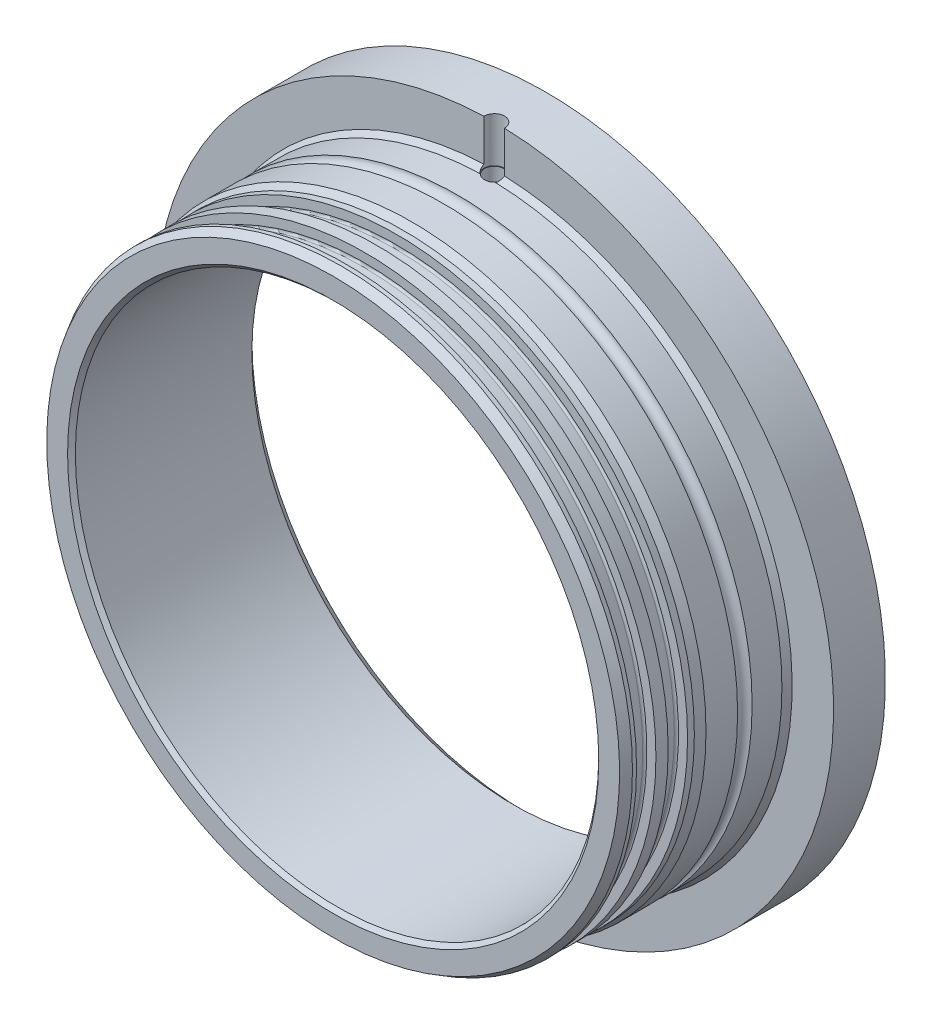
ISO-10303-21;
HEADER;
FILE_DESCRIPTION(('STEP AP214'),'2;1');
FILE_NAME('part.step','',(''),(''),'','','');
FILE_SCHEMA(('AUTOMOTIVE_DESIGN { 1 0 10303 214 1 1 1 1 }'));
ENDSEC;
DATA;
#1=APPLICATION_CONTEXT('core data for automotive mechanical design processes');
#2=APPLICATION_PROTOCOL_DEFINITION('international standard','automotive_design',2000,#1);
#3=PRODUCT_CONTEXT('',#1,'mechanical');
#4=PRODUCT('Part','Part','',(#3));
#5=PRODUCT_RELATED_PRODUCT_CATEGORY('part','',(#4));
#6=PRODUCT_DEFINITION_FORMATION('','',#4);
#7=PRODUCT_DEFINITION_CONTEXT('part definition',#1,'design');
#8=PRODUCT_DEFINITION('design','',#6,#7);
#9=PRODUCT_DEFINITION_SHAPE('','',#8);
#10=(LENGTH_UNIT() NAMED_UNIT(*) SI_UNIT(.MILLI.,.METRE.));
#11=(NAMED_UNIT(*) PLANE_ANGLE_UNIT() SI_UNIT($,.RADIAN.));
#12=(NAMED_UNIT(*) SI_UNIT($,.STERADIAN.) SOLID_ANGLE_UNIT());
#13=UNCERTAINTY_MEASURE_WITH_UNIT(LENGTH_MEASURE(1.E-05),#10,'distance_accuracy_value','');
#14=(GEOMETRIC_REPRESENTATION_CONTEXT(3) GLOBAL_UNCERTAINTY_ASSIGNED_CONTEXT((#13)) GLOBAL_UNIT_ASSIGNED_CONTEXT((#10,
#11,#12)) REPRESENTATION_CONTEXT('',''));
#15=CARTESIAN_POINT('',(0.,0.,0.));
#16=DIRECTION('',(0.,0.,1.));
#17=DIRECTION('',(1.,0.,0.));
#18=AXIS2_PLACEMENT_3D('',#15,#16,#17);
#19=CARTESIAN_POINT('',(0.,0.,-19.2957));
#20=DIRECTION('',(0.,0.,-1.));
#21=DIRECTION('',(0.,1.,0.));
#22=AXIS2_PLACEMENT_3D('',#19,#20,#21);
#23=PLANE('',#22);
#24=CARTESIAN_POINT('',(0.,0.,-19.2957));
#25=DIRECTION('',(0.,0.,-1.));
#26=DIRECTION('',(0.,1.,0.));
#27=AXIS2_PLACEMENT_3D('',#24,#25,#26);
#28=CIRCLE('',#27,72.7074999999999);
#29=CARTESIAN_POINT('',(0.,72.7074999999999,-19.2957));
#30=VERTEX_POINT('',#29);
#31=EDGE_CURVE('E13',#30,#30,#28,.T.);
#32=ORIENTED_EDGE('',*,*,#31,.T.);
#33=EDGE_LOOP('',(#32));
#34=FACE_BOUND('',#33,.T.);
#35=CARTESIAN_POINT('',(0.,0.,-19.2957));
#36=DIRECTION('',(0.,0.,-1.));
#37=DIRECTION('',(0.,1.,0.));
#38=AXIS2_PLACEMENT_3D('',#35,#36,#37);
#39=CIRCLE('',#38,66.6750000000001);
#40=CARTESIAN_POINT('',(0.,66.6750000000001,-19.2957));
#41=VERTEX_POINT('',#40);
#42=EDGE_CURVE('E674',#41,#41,#39,.F.);
#43=ORIENTED_EDGE('',*,*,#42,.T.);
#44=EDGE_LOOP('',(#43));
#45=FACE_BOUND('',#44,.T.);
#46=ADVANCED_FACE('F52',(#34,#45),#23,.T.);
#47=CARTESIAN_POINT('',(0.,0.,-11.9932));
#48=DIRECTION('',(0.,0.,-1.));
#49=DIRECTION('',(-1.,0.,0.));
#50=AXIS2_PLACEMENT_3D('',#47,#48,#49);
#51=PLANE('',#50);
#52=CARTESIAN_POINT('',(0.,0.,-11.9932));
#53=DIRECTION('',(0.,0.,-1.));
#54=DIRECTION('',(-1.,0.,0.));
#55=AXIS2_PLACEMENT_3D('',#52,#53,#54);
#56=CIRCLE('',#55,83.185);
#57=CARTESIAN_POINT('',(2.53999999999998,83.1462123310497,-11.9932));
#58=VERTEX_POINT('',#57);
#59=CARTESIAN_POINT('',(-2.54000000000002,83.1462138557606,-11.9932));
#60=VERTEX_POINT('',#59);
#61=EDGE_CURVE('E101',#58,#60,#56,.T.);
#62=ORIENTED_EDGE('',*,*,#61,.F.);
#63=DIRECTION('',(0.,-1.,0.));
#64=VECTOR('',#63,1.);
#65=CARTESIAN_POINT('',(2.53999999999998,83.185001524,-11.9932));
#66=LINE('',#65,#64);
#67=CARTESIAN_POINT('',(2.53999999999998,72.9843584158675,-11.9932));
#68=VERTEX_POINT('',#67);
#69=EDGE_CURVE('E111',#68,#58,#66,.F.);
#70=ORIENTED_EDGE('',*,*,#69,.F.);
#71=CARTESIAN_POINT('',(0.,0.,-11.9932));
#72=DIRECTION('',(0.,0.,-1.));
#73=DIRECTION('',(-1.,0.,0.));
#74=AXIS2_PLACEMENT_3D('',#71,#72,#73);
#75=CIRCLE('',#74,73.0285435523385);
#76=CARTESIAN_POINT('',(-2.54000000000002,72.9843584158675,-11.9932));
#77=VERTEX_POINT('',#76);
#78=EDGE_CURVE('E676',#68,#77,#75,.T.);
#79=ORIENTED_EDGE('',*,*,#78,.T.);
#80=DIRECTION('',(0.,-1.,0.));
#81=VECTOR('',#80,1.);
#82=CARTESIAN_POINT('',(-2.54000000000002,83.185001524,-11.9932));
#83=LINE('',#82,#81);
#84=EDGE_CURVE('E113',#60,#77,#83,.T.);
#85=ORIENTED_EDGE('',*,*,#84,.F.);
#86=EDGE_LOOP('',(#62,#70,#79,#85));
#87=FACE_BOUND('',#86,.T.);
#88=ADVANCED_FACE('F109',(#87),#51,.F.);
#89=CARTESIAN_POINT('',(0.,0.,-24.6932));
#90=DIRECTION('',(0.,0.,-1.));
#91=DIRECTION('',(-1.,0.,0.));
#92=AXIS2_PLACEMENT_3D('',#89,#90,#91);
#93=PLANE('',#92);
#94=CARTESIAN_POINT('',(0.,0.,-24.6932));
#95=DIRECTION('',(0.,0.,-1.));
#96=DIRECTION('',(-1.,0.,0.));
#97=AXIS2_PLACEMENT_3D('',#94,#95,#96);
#98=CIRCLE('',#97,83.185);
#99=CARTESIAN_POINT('',(-83.185,0.,-24.6932));
#100=VERTEX_POINT('',#99);
#101=EDGE_CURVE('E115',#100,#100,#98,.T.);
#102=ORIENTED_EDGE('',*,*,#101,.T.);
#103=EDGE_LOOP('',(#102));
#104=FACE_BOUND('',#103,.T.);
#105=CARTESIAN_POINT('',(0.,0.,-24.6932));
#106=DIRECTION('',(0.,0.,-1.));
#107=DIRECTION('',(0.,1.,0.));
#108=AXIS2_PLACEMENT_3D('',#105,#106,#107);
#109=CIRCLE('',#108,74.295);
#110=CARTESIAN_POINT('',(0.,74.295,-24.6932));
#111=VERTEX_POINT('',#110);
#112=EDGE_CURVE('E694',#111,#111,#109,.T.);
#113=ORIENTED_EDGE('',*,*,#112,.F.);
#114=EDGE_LOOP('',(#113));
#115=FACE_BOUND('',#114,.T.);
#116=ADVANCED_FACE('F221',(#104,#115),#93,.T.);
#117=CARTESIAN_POINT('',(0.,0.,0.));
#118=DIRECTION('',(0.,0.,1.));
#119=DIRECTION('',(1.,0.,0.));
#120=AXIS2_PLACEMENT_3D('',#117,#118,#119);
#121=CYLINDRICAL_SURFACE('',#120,72.112);
#122=CARTESIAN_POINT('',(0.,0.,0.452800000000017));
#123=DIRECTION('',(0.,0.,-1.));
#124=DIRECTION('',(-1.,0.,0.));
#125=AXIS2_PLACEMENT_3D('',#122,#123,#124);
#126=CIRCLE('',#125,72.112);
#127=CARTESIAN_POINT('',(-72.112,0.,0.452800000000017));
#128=VERTEX_POINT('',#127);
#129=EDGE_CURVE('E668',#128,#128,#126,.T.);
#130=ORIENTED_EDGE('',*,*,#129,.F.);
#131=EDGE_LOOP('',(#130));
#132=FACE_BOUND('',#131,.T.);
#133=CARTESIAN_POINT('',(0.,0.,8.19680000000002));
#134=DIRECTION('',(0.,0.,1.));
#135=DIRECTION('',(1.,0.,0.));
#136=AXIS2_PLACEMENT_3D('',#133,#134,#135);
#137=CIRCLE('',#136,72.112);
#138=CARTESIAN_POINT('',(72.112,0.,8.19680000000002));
#139=VERTEX_POINT('',#138);
#140=EDGE_CURVE('E120',#139,#139,#137,.T.);
#141=ORIENTED_EDGE('',*,*,#140,.F.);
#142=EDGE_LOOP('',(#141));
#143=FACE_BOUND('',#142,.T.);
#144=ADVANCED_FACE('F330',(#132,#143),#121,.T.);
#145=CARTESIAN_POINT('',(0.,0.,0.));
#146=DIRECTION('',(0.,0.,1.));
#147=DIRECTION('',(1.,0.,0.));
#148=AXIS2_PLACEMENT_3D('',#145,#146,#147);
#149=CYLINDRICAL_SURFACE('',#148,71.35);
#150=CARTESIAN_POINT('',(0.,0.,11.9588));
#151=DIRECTION('',(0.,0.,1.));
#152=DIRECTION('',(1.,0.,0.));
#153=AXIS2_PLACEMENT_3D('',#150,#151,#152);
#154=CIRCLE('',#153,71.35);
#155=CARTESIAN_POINT('',(71.35,0.,11.9588));
#156=VERTEX_POINT('',#155);
#157=EDGE_CURVE('E135',#156,#156,#154,.F.);
#158=ORIENTED_EDGE('',*,*,#157,.T.);
#159=EDGE_LOOP('',(#158));
#160=FACE_BOUND('',#159,.T.);
#161=CARTESIAN_POINT('',(0.,0.,10.2903777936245));
#162=DIRECTION('',(0.,0.,1.));
#163=DIRECTION('',(1.,0.,0.));
#164=AXIS2_PLACEMENT_3D('',#161,#162,#163);
#165=CIRCLE('',#164,71.35);
#166=CARTESIAN_POINT('',(71.35,0.,10.2903777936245));
#167=VERTEX_POINT('',#166);
#168=EDGE_CURVE('E123',#167,#167,#165,.T.);
#169=ORIENTED_EDGE('',*,*,#168,.T.);
#170=EDGE_LOOP('',(#169));
#171=FACE_BOUND('',#170,.T.);
#172=ADVANCED_FACE('F331',(#160,#171),#149,.T.);
#173=CARTESIAN_POINT('',(0.,71.35,27.4584));
#174=DIRECTION('',(0.,0.,-1.));
#175=DIRECTION('',(-1.,0.,0.));
#176=AXIS2_PLACEMENT_3D('',#173,#174,#175);
#177=PLANE('',#176);
#178=CARTESIAN_POINT('',(0.,0.,27.4584));
#179=DIRECTION('',(0.,0.,-1.));
#180=DIRECTION('',(-1.,0.,0.));
#181=AXIS2_PLACEMENT_3D('',#178,#179,#180);
#182=CIRCLE('',#181,65.0875);
#183=CARTESIAN_POINT('',(65.0875,0.,27.4584));
#184=VERTEX_POINT('',#183);
#185=EDGE_CURVE('E271',#184,#184,#182,.T.);
#186=ORIENTED_EDGE('',*,*,#185,.T.);
#187=EDGE_LOOP('',(#186));
#188=FACE_BOUND('',#187,.T.);
#189=CARTESIAN_POINT('',(0.,0.,27.4584));
#190=DIRECTION('',(0.,0.,-1.));
#191=DIRECTION('',(0.,1.,0.));
#192=AXIS2_PLACEMENT_3D('',#189,#190,#191);
#193=CIRCLE('',#192,70.1952994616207);
#194=CARTESIAN_POINT('',(0.,70.1952994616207,27.4584));
#195=VERTEX_POINT('',#194);
#196=EDGE_CURVE('E130',#195,#195,#193,.T.);
#197=ORIENTED_EDGE('',*,*,#196,.F.);
#198=EDGE_LOOP('',(#197));
#199=FACE_BOUND('',#198,.T.);
#200=ADVANCED_FACE('F334',(#188,#199),#177,.F.);
#201=CARTESIAN_POINT('',(0.,0.,25.4583999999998));
#202=DIRECTION('',(0.,0.,-1.));
#203=DIRECTION('',(0.,1.,0.));
#204=AXIS2_PLACEMENT_3D('',#201,#202,#203);
#205=CONICAL_SURFACE('',#204,71.35,0.523598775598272);
#206=CARTESIAN_POINT('',(0.,0.,25.4583999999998));
#207=DIRECTION('',(0.,0.,1.));
#208=DIRECTION('',(1.,0.,0.));
#209=AXIS2_PLACEMENT_3D('',#206,#207,#208);
#210=CIRCLE('',#209,71.35);
#211=CARTESIAN_POINT('',(71.35,0.,25.4583999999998));
#212=VERTEX_POINT('',#211);
#213=EDGE_CURVE('E131',#212,#212,#210,.F.);
#214=ORIENTED_EDGE('',*,*,#213,.F.);
#215=EDGE_LOOP('',(#214));
#216=FACE_BOUND('',#215,.T.);
#217=ORIENTED_EDGE('',*,*,#196,.T.);
#218=EDGE_LOOP('',(#217));
#219=FACE_BOUND('',#218,.T.);
#220=ADVANCED_FACE('F366',(#216,#219),#205,.T.);
#221=CARTESIAN_POINT('',(0.,0.,0.));
#222=DIRECTION('',(0.,0.,1.));
#223=DIRECTION('',(1.,0.,0.));
#224=AXIS2_PLACEMENT_3D('',#221,#222,#223);
#225=CYLINDRICAL_SURFACE('',#224,71.35);
#226=ORIENTED_EDGE('',*,*,#213,.T.);
#227=EDGE_LOOP('',(#226));
#228=FACE_BOUND('',#227,.T.);
#229=CARTESIAN_POINT('',(0.,0.,24.4584));
#230=DIRECTION('',(0.,0.,1.));
#231=DIRECTION('',(1.,0.,0.));
#232=AXIS2_PLACEMENT_3D('',#229,#230,#231);
#233=CIRCLE('',#232,71.35);
#234=CARTESIAN_POINT('',(71.35,0.,24.4584));
#235=VERTEX_POINT('',#234);
#236=EDGE_CURVE('E134',#235,#235,#233,.T.);
#237=ORIENTED_EDGE('',*,*,#236,.T.);
#238=EDGE_LOOP('',(#237));
#239=FACE_BOUND('',#238,.T.);
#240=ADVANCED_FACE('F362',(#228,#239),#225,.T.);
#241=CARTESIAN_POINT('',(0.,68.6181,24.4584));
#242=DIRECTION('',(0.,0.,1.));
#243=DIRECTION('',(1.,0.,0.));
#244=AXIS2_PLACEMENT_3D('',#241,#242,#243);
#245=PLANE('',#244);
#246=CARTESIAN_POINT('',(0.,0.,24.4584));
#247=DIRECTION('',(0.,0.,1.));
#248=DIRECTION('',(1.,0.,0.));
#249=AXIS2_PLACEMENT_3D('',#246,#247,#248);
#250=CIRCLE('',#249,69.1261);
#251=CARTESIAN_POINT('',(69.1261,0.,24.4584));
#252=VERTEX_POINT('',#251);
#253=EDGE_CURVE('E105',#252,#252,#250,.T.);
#254=ORIENTED_EDGE('',*,*,#253,.T.);
#255=EDGE_LOOP('',(#254));
#256=FACE_BOUND('',#255,.T.);
#257=ORIENTED_EDGE('',*,*,#236,.F.);
#258=EDGE_LOOP('',(#257));
#259=FACE_BOUND('',#258,.T.);
#260=ADVANCED_FACE('F358',(#256,#259),#245,.F.);
#261=CARTESIAN_POINT('',(0.,0.,0.));
#262=DIRECTION('',(0.,0.,1.));
#263=DIRECTION('',(1.,0.,0.));
#264=AXIS2_PLACEMENT_3D('',#261,#262,#263);
#265=CYLINDRICAL_SURFACE('',#264,68.6181);
#266=CARTESIAN_POINT('',(0.,0.,20.2166));
#267=DIRECTION('',(0.,0.,-1.));
#268=DIRECTION('',(-1.,0.,0.));
#269=AXIS2_PLACEMENT_3D('',#266,#267,#268);
#270=CIRCLE('',#269,68.6181);
#271=CARTESIAN_POINT('',(-68.6181,0.,20.2166));
#272=VERTEX_POINT('',#271);
#273=EDGE_CURVE('E196',#272,#272,#270,.F.);
#274=ORIENTED_EDGE('',*,*,#273,.T.);
#275=EDGE_LOOP('',(#274));
#276=FACE_BOUND('',#275,.T.);
#277=CARTESIAN_POINT('',(0.,0.,23.9504));
#278=DIRECTION('',(0.,0.,1.));
#279=DIRECTION('',(1.,0.,0.));
#280=AXIS2_PLACEMENT_3D('',#277,#278,#279);
#281=CIRCLE('',#280,68.6181);
#282=CARTESIAN_POINT('',(68.6181,0.,23.9504));
#283=VERTEX_POINT('',#282);
#284=EDGE_CURVE('E193',#283,#283,#281,.F.);
#285=ORIENTED_EDGE('',*,*,#284,.T.);
#286=EDGE_LOOP('',(#285));
#287=FACE_BOUND('',#286,.T.);
#288=ADVANCED_FACE('F354',(#276,#287),#265,.T.);
#289=CARTESIAN_POINT('',(0.,71.35,19.7086));
#290=DIRECTION('',(0.,0.,-1.));
#291=DIRECTION('',(-1.,0.,0.));
#292=AXIS2_PLACEMENT_3D('',#289,#290,#291);
#293=PLANE('',#292);
#294=CARTESIAN_POINT('',(0.,0.,19.7086));
#295=DIRECTION('',(0.,0.,-1.));
#296=DIRECTION('',(-1.,0.,0.));
#297=AXIS2_PLACEMENT_3D('',#294,#295,#296);
#298=CIRCLE('',#297,69.1261);
#299=CARTESIAN_POINT('',(-69.1261,0.,19.7086));
#300=VERTEX_POINT('',#299);
#301=EDGE_CURVE('E199',#300,#300,#298,.T.);
#302=ORIENTED_EDGE('',*,*,#301,.T.);
#303=EDGE_LOOP('',(#302));
#304=FACE_BOUND('',#303,.T.);
#305=CARTESIAN_POINT('',(0.,0.,19.7086));
#306=DIRECTION('',(0.,0.,1.));
#307=DIRECTION('',(1.,0.,0.));
#308=AXIS2_PLACEMENT_3D('',#305,#306,#307);
#309=CIRCLE('',#308,71.35);
#310=CARTESIAN_POINT('',(71.35,0.,19.7086));
#311=VERTEX_POINT('',#310);
#312=EDGE_CURVE('E143',#311,#311,#309,.F.);
#313=ORIENTED_EDGE('',*,*,#312,.F.);
#314=EDGE_LOOP('',(#313));
#315=FACE_BOUND('',#314,.T.);
#316=ADVANCED_FACE('F350',(#304,#315),#293,.F.);
#317=CARTESIAN_POINT('',(0.,0.,0.));
#318=DIRECTION('',(0.,0.,1.));
#319=DIRECTION('',(1.,0.,0.));
#320=AXIS2_PLACEMENT_3D('',#317,#318,#319);
#321=CYLINDRICAL_SURFACE('',#320,71.35);
#322=ORIENTED_EDGE('',*,*,#312,.T.);
#323=EDGE_LOOP('',(#322));
#324=FACE_BOUND('',#323,.T.);
#325=CARTESIAN_POINT('',(0.,0.,16.7086));
#326=DIRECTION('',(0.,0.,1.));
#327=DIRECTION('',(1.,0.,0.));
#328=AXIS2_PLACEMENT_3D('',#325,#326,#327);
#329=CIRCLE('',#328,71.35);
#330=CARTESIAN_POINT('',(71.35,0.,16.7086));
#331=VERTEX_POINT('',#330);
#332=EDGE_CURVE('E139',#331,#331,#329,.T.);
#333=ORIENTED_EDGE('',*,*,#332,.T.);
#334=EDGE_LOOP('',(#333));
#335=FACE_BOUND('',#334,.T.);
#336=ADVANCED_FACE('F346',(#324,#335),#321,.T.);
#337=CARTESIAN_POINT('',(0.,68.6181,16.7086));
#338=DIRECTION('',(0.,0.,1.));
#339=DIRECTION('',(1.,0.,0.));
#340=AXIS2_PLACEMENT_3D('',#337,#338,#339);
#341=PLANE('',#340);
#342=CARTESIAN_POINT('',(0.,0.,16.7086));
#343=DIRECTION('',(0.,0.,1.));
#344=DIRECTION('',(1.,0.,0.));
#345=AXIS2_PLACEMENT_3D('',#342,#343,#344);
#346=CIRCLE('',#345,69.1261);
#347=CARTESIAN_POINT('',(69.1261,0.,16.7086));
#348=VERTEX_POINT('',#347);
#349=EDGE_CURVE('E190',#348,#348,#346,.T.);
#350=ORIENTED_EDGE('',*,*,#349,.T.);
#351=EDGE_LOOP('',(#350));
#352=FACE_BOUND('',#351,.T.);
#353=ORIENTED_EDGE('',*,*,#332,.F.);
#354=EDGE_LOOP('',(#353));
#355=FACE_BOUND('',#354,.T.);
#356=ADVANCED_FACE('F342',(#352,#355),#341,.F.);
#357=CARTESIAN_POINT('',(0.,0.,0.));
#358=DIRECTION('',(0.,0.,1.));
#359=DIRECTION('',(1.,0.,0.));
#360=AXIS2_PLACEMENT_3D('',#357,#358,#359);
#361=CYLINDRICAL_SURFACE('',#360,68.6181);
#362=CARTESIAN_POINT('',(0.,0.,12.4668));
#363=DIRECTION('',(0.,0.,-1.));
#364=DIRECTION('',(-1.,0.,0.));
#365=AXIS2_PLACEMENT_3D('',#362,#363,#364);
#366=CIRCLE('',#365,68.6181);
#367=CARTESIAN_POINT('',(-68.6181,0.,12.4668));
#368=VERTEX_POINT('',#367);
#369=EDGE_CURVE('E184',#368,#368,#366,.F.);
#370=ORIENTED_EDGE('',*,*,#369,.T.);
#371=EDGE_LOOP('',(#370));
#372=FACE_BOUND('',#371,.T.);
#373=CARTESIAN_POINT('',(0.,0.,16.2006));
#374=DIRECTION('',(0.,0.,1.));
#375=DIRECTION('',(1.,0.,0.));
#376=AXIS2_PLACEMENT_3D('',#373,#374,#375);
#377=CIRCLE('',#376,68.6181);
#378=CARTESIAN_POINT('',(68.6181,0.,16.2006));
#379=VERTEX_POINT('',#378);
#380=EDGE_CURVE('E138',#379,#379,#377,.F.);
#381=ORIENTED_EDGE('',*,*,#380,.T.);
#382=EDGE_LOOP('',(#381));
#383=FACE_BOUND('',#382,.T.);
#384=ADVANCED_FACE('F338',(#372,#383),#361,.T.);
#385=CARTESIAN_POINT('',(0.,71.35,11.9588));
#386=DIRECTION('',(0.,0.,-1.));
#387=DIRECTION('',(-1.,0.,0.));
#388=AXIS2_PLACEMENT_3D('',#385,#386,#387);
#389=PLANE('',#388);
#390=CARTESIAN_POINT('',(0.,0.,11.9588));
#391=DIRECTION('',(0.,0.,-1.));
#392=DIRECTION('',(-1.,0.,0.));
#393=AXIS2_PLACEMENT_3D('',#390,#391,#392);
#394=CIRCLE('',#393,69.1261);
#395=CARTESIAN_POINT('',(-69.1261,0.,11.9588));
#396=VERTEX_POINT('',#395);
#397=EDGE_CURVE('E187',#396,#396,#394,.T.);
#398=ORIENTED_EDGE('',*,*,#397,.T.);
#399=EDGE_LOOP('',(#398));
#400=FACE_BOUND('',#399,.T.);
#401=ORIENTED_EDGE('',*,*,#157,.F.);
#402=EDGE_LOOP('',(#401));
#403=FACE_BOUND('',#402,.T.);
#404=ADVANCED_FACE('F328',(#400,#403),#389,.F.);
#405=CARTESIAN_POINT('',(0.,0.,-3.1032));
#406=DIRECTION('',(0.,0.,1.));
#407=DIRECTION('',(1.,0.,0.));
#408=AXIS2_PLACEMENT_3D('',#405,#406,#407);
#409=CIRCLE('',#408,72.112);
#410=CARTESIAN_POINT('',(72.112,0.,-3.1032));
#411=VERTEX_POINT('',#410);
#412=EDGE_CURVE('E669',#411,#411,#409,.T.);
#413=ORIENTED_EDGE('',*,*,#412,.F.);
#414=EDGE_LOOP('',(#413));
#415=FACE_BOUND('',#414,.T.);
#416=CARTESIAN_POINT('',(-2.38125000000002,72.072672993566,-11.9932));
#417=CARTESIAN_POINT('',(-2.38124957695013,72.0726724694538,-11.9262252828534));
#418=CARTESIAN_POINT('',(-2.37842264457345,72.0727664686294,-11.8592826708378));
#419=CARTESIAN_POINT('',(-2.36714500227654,72.0731379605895,-11.7258768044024));
#420=CARTESIAN_POINT('',(-2.3586945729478,72.0734154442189,-11.6594135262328));
#421=CARTESIAN_POINT('',(-2.32498788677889,72.0745136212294,-11.4615690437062));
#422=CARTESIAN_POINT('',(-2.29137601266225,72.0756000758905,-11.3315137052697));
#423=CARTESIAN_POINT('',(-2.20280673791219,72.0783610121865,-11.0789016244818));
#424=CARTESIAN_POINT('',(-2.14783963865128,72.0800357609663,-10.9563483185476));
#425=CARTESIAN_POINT('',(-2.01812860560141,72.0837838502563,-10.7222139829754));
#426=CARTESIAN_POINT('',(-1.94338839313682,72.0858571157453,-10.6106308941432));
#427=CARTESIAN_POINT('',(-1.7762172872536,72.0901697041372,-10.4015566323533));
#428=CARTESIAN_POINT('',(-1.68378000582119,72.0924090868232,-10.3040705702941));
#429=CARTESIAN_POINT('',(-1.48383691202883,72.0968012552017,-10.1259816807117));
#430=CARTESIAN_POINT('',(-1.37632880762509,72.098954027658,-10.0453814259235));
#431=CARTESIAN_POINT('',(-1.14928150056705,72.1029303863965,-9.90335850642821));
#432=CARTESIAN_POINT('',(-1.02974008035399,72.1047539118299,-9.84193938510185));
#433=CARTESIAN_POINT('',(-0.78204299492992,72.1078655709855,-9.74004824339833));
#434=CARTESIAN_POINT('',(-0.653887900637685,72.1091537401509,-9.6995748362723));
#435=CARTESIAN_POINT('',(-0.392641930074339,72.1110492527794,-9.64073201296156));
#436=CARTESIAN_POINT('',(-0.259552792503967,72.1116568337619,-9.62235488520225));
#437=CARTESIAN_POINT('',(0.00782602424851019,72.1121234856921,-9.60820240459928));
#438=CARTESIAN_POINT('',(0.142115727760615,72.1119825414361,-9.61242751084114));
#439=CARTESIAN_POINT('',(0.408023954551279,72.1109682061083,-9.64335386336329));
#440=CARTESIAN_POINT('',(0.539643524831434,72.1100951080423,-9.67004611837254));
#441=CARTESIAN_POINT('',(0.796531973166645,72.1077152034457,-9.74513508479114));
#442=CARTESIAN_POINT('',(0.92180086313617,72.1062083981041,-9.7935317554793));
#443=CARTESIAN_POINT('',(1.16246402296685,72.1027303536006,-9.91066715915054));
#444=CARTESIAN_POINT('',(1.27785607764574,72.1007590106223,-9.97941044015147));
#445=CARTESIAN_POINT('',(1.49545947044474,72.0965741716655,-10.1352810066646));
#446=CARTESIAN_POINT('',(1.59767140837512,72.0943606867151,-10.2224074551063));
#447=CARTESIAN_POINT('',(1.78605816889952,72.0899399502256,-10.4126076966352));
#448=CARTESIAN_POINT('',(1.87222746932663,72.0877327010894,-10.5156869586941));
#449=CARTESIAN_POINT('',(2.02606628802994,72.0835733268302,-10.7348928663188));
#450=CARTESIAN_POINT('',(2.09372994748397,72.081621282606,-10.8510236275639));
#451=CARTESIAN_POINT('',(2.20863281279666,72.0781922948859,-11.0930539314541));
#452=CARTESIAN_POINT('',(2.25585935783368,72.0767156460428,-11.218959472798));
#453=CARTESIAN_POINT('',(2.32842972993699,72.074408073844,-11.4768205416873));
#454=CARTESIAN_POINT('',(2.35380694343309,72.0735761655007,-11.6087665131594));
#455=CARTESIAN_POINT('',(2.37237582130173,72.0729656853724,-11.7835285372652));
#456=CARTESIAN_POINT('',(2.37570538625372,72.0728559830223,-11.8254305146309));
#457=CARTESIAN_POINT('',(2.38013944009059,72.0727097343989,-11.9092826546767));
#458=CARTESIAN_POINT('',(2.38124760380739,72.072673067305,-11.9512326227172));
#459=CARTESIAN_POINT('',(2.38124999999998,72.072672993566,-11.9932));
#460=B_SPLINE_CURVE_WITH_KNOTS('',3,(#416,#417,#418,#419,#420,#421,#422,#423,#424,#425,#426,
#427,#428,#429,#430,#431,#432,#433,#434,#435,#436,#437,#438,#439,#440,#441,#442,#443,#444,#445,
#446,#447,#448,#449,#450,#451,#452,#453,#454,#455,#456,#457,#458,#459),.UNSPECIFIED.,.F.,.F.,(4,
2,2,2,2,2,2,2,2,2,2,2,2,2,2,2,2,2,2,2,2,4),(0.,0.200800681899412,0.401591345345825,
0.802522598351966,1.20363615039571,1.60467426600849,2.0058574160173,2.40710164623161,
2.80841995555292,3.20971169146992,3.61086333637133,4.01202312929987,4.41302245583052,
4.81402103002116,5.2151093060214,5.61617932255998,6.01738714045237,6.41872183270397,
6.82030479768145,7.22127303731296,7.34733442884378,7.47318710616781),.UNSPECIFIED.);
#461=CARTESIAN_POINT('',(-1.77487895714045,72.0901543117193,-10.4056999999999));
#462=VERTEX_POINT('',#461);
#463=CARTESIAN_POINT('',(1.77487895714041,72.0901543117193,-10.4056999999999));
#464=VERTEX_POINT('',#463);
#465=EDGE_CURVE('E314',#462,#464,#460,.T.);
#466=ORIENTED_EDGE('',*,*,#465,.F.);
#467=CARTESIAN_POINT('',(0.,0.,-10.4057));
#468=DIRECTION('',(0.,0.,-1.));
#469=DIRECTION('',(-1.,0.,0.));
#470=AXIS2_PLACEMENT_3D('',#467,#468,#469);
#471=CIRCLE('',#470,72.112);
#472=EDGE_CURVE('E234',#462,#464,#471,.F.);
#473=ORIENTED_EDGE('',*,*,#472,.T.);
#474=EDGE_LOOP('',(#466,#473));
#475=FACE_BOUND('',#474,.T.);
#476=ADVANCED_FACE('F323',(#415,#475),#121,.T.);
#477=CARTESIAN_POINT('',(0.,0.,8.19680000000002));
#478=DIRECTION('',(0.,0.,-1.));
#479=DIRECTION('',(-1.,0.,0.));
#480=AXIS2_PLACEMENT_3D('',#477,#478,#479);
#481=CONICAL_SURFACE('',#480,72.112,0.349065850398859);
#482=ORIENTED_EDGE('',*,*,#168,.F.);
#483=EDGE_LOOP('',(#482));
#484=FACE_BOUND('',#483,.T.);
#485=ORIENTED_EDGE('',*,*,#140,.T.);
#486=EDGE_LOOP('',(#485));
#487=FACE_BOUND('',#486,.T.);
#488=ADVANCED_FACE('F327',(#484,#487),#481,.T.);
#489=CARTESIAN_POINT('',(0.,0.,12.4668));
#490=DIRECTION('',(0.,0.,-1.));
#491=DIRECTION('',(-1.,0.,0.));
#492=AXIS2_PLACEMENT_3D('',#489,#490,#491);
#493=TOROIDAL_SURFACE('',#492,69.1261,0.508);
#494=ORIENTED_EDGE('',*,*,#397,.F.);
#495=EDGE_LOOP('',(#494));
#496=FACE_BOUND('',#495,.T.);
#497=ORIENTED_EDGE('',*,*,#369,.F.);
#498=EDGE_LOOP('',(#497));
#499=FACE_BOUND('',#498,.T.);
#500=ADVANCED_FACE('F374',(#496,#499),#493,.F.);
#501=CARTESIAN_POINT('',(0.,0.,16.2006));
#502=DIRECTION('',(0.,0.,1.));
#503=DIRECTION('',(1.,0.,0.));
#504=AXIS2_PLACEMENT_3D('',#501,#502,#503);
#505=TOROIDAL_SURFACE('',#504,69.1261,0.508);
#506=ORIENTED_EDGE('',*,*,#349,.F.);
#507=EDGE_LOOP('',(#506));
#508=FACE_BOUND('',#507,.T.);
#509=ORIENTED_EDGE('',*,*,#380,.F.);
#510=EDGE_LOOP('',(#509));
#511=FACE_BOUND('',#510,.T.);
#512=ADVANCED_FACE('F377',(#508,#511),#505,.F.);
#513=CARTESIAN_POINT('',(0.,0.,20.2166));
#514=DIRECTION('',(0.,0.,-1.));
#515=DIRECTION('',(-1.,0.,0.));
#516=AXIS2_PLACEMENT_3D('',#513,#514,#515);
#517=TOROIDAL_SURFACE('',#516,69.1261,0.508);
#518=ORIENTED_EDGE('',*,*,#301,.F.);
#519=EDGE_LOOP('',(#518));
#520=FACE_BOUND('',#519,.T.);
#521=ORIENTED_EDGE('',*,*,#273,.F.);
#522=EDGE_LOOP('',(#521));
#523=FACE_BOUND('',#522,.T.);
#524=ADVANCED_FACE('F381',(#520,#523),#517,.F.);
#525=CARTESIAN_POINT('',(0.,0.,23.9504));
#526=DIRECTION('',(0.,0.,1.));
#527=DIRECTION('',(1.,0.,0.));
#528=AXIS2_PLACEMENT_3D('',#525,#526,#527);
#529=TOROIDAL_SURFACE('',#528,69.1261,0.508);
#530=ORIENTED_EDGE('',*,*,#253,.F.);
#531=EDGE_LOOP('',(#530));
#532=FACE_BOUND('',#531,.T.);
#533=ORIENTED_EDGE('',*,*,#284,.F.);
#534=EDGE_LOOP('',(#533));
#535=FACE_BOUND('',#534,.T.);
#536=ADVANCED_FACE('F384',(#532,#535),#529,.F.);
#537=CARTESIAN_POINT('',(0.,72.112,-11.9932));
#538=DIRECTION('',(0.,1.,0.));
#539=DIRECTION('',(-1.,0.,0.));
#540=AXIS2_PLACEMENT_3D('',#537,#538,#539);
#541=PLANE('',#540);
#542=CARTESIAN_POINT('',(0.,72.112,-11.9932));
#543=DIRECTION('',(0.,1.,0.));
#544=DIRECTION('',(-1.,0.,0.));
#545=AXIS2_PLACEMENT_3D('',#542,#543,#544);
#546=CIRCLE('',#545,2.38125);
#547=CARTESIAN_POINT('',(1.8092670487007,72.112,-10.4450061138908));
#548=VERTEX_POINT('',#547);
#549=CARTESIAN_POINT('',(-1.80926704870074,72.112,-10.4450061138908));
#550=VERTEX_POINT('',#549);
#551=EDGE_CURVE('E74',#548,#550,#546,.T.);
#552=ORIENTED_EDGE('',*,*,#551,.F.);
#553=CARTESIAN_POINT('',(1.8092670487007,72.112,-10.4450061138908));
#554=CARTESIAN_POINT('',(1.84457312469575,72.112,-10.4465399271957));
#555=CARTESIAN_POINT('',(1.87987714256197,72.112,-10.4481184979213));
#556=CARTESIAN_POINT('',(1.95048106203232,72.112,-10.451365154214));
#557=CARTESIAN_POINT('',(1.98578096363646,72.112,-10.4530332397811));
#558=CARTESIAN_POINT('',(2.02107880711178,72.112,-10.4547460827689));
#559=B_SPLINE_CURVE_WITH_KNOTS('',3,(#553,#554,#555,#556,#557,#558),.UNSPECIFIED.,.F.,.F.,(4,2,
4),(0.,0.106017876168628,0.212035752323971),.UNSPECIFIED.);
#560=CARTESIAN_POINT('',(2.02107880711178,72.112,-10.4547460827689));
#561=VERTEX_POINT('',#560);
#562=EDGE_CURVE('E263',#548,#561,#559,.T.);
#563=ORIENTED_EDGE('',*,*,#562,.T.);
#564=CARTESIAN_POINT('',(0.,72.112,-11.9932));
#565=DIRECTION('',(0.,1.,0.));
#566=DIRECTION('',(-1.,0.,0.));
#567=AXIS2_PLACEMENT_3D('',#564,#565,#566);
#568=CIRCLE('',#567,2.54);
#569=CARTESIAN_POINT('',(-2.02107880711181,72.112,-10.4547460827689));
#570=VERTEX_POINT('',#569);
#571=EDGE_CURVE('E67',#561,#570,#568,.T.);
#572=ORIENTED_EDGE('',*,*,#571,.T.);
#573=CARTESIAN_POINT('',(-2.02107880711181,72.112,-10.4547460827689));
#574=CARTESIAN_POINT('',(-1.9857809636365,72.112,-10.4530332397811));
#575=CARTESIAN_POINT('',(-1.95048106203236,72.112,-10.451365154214));
#576=CARTESIAN_POINT('',(-1.879877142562,72.112,-10.4481184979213));
#577=CARTESIAN_POINT('',(-1.84457312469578,72.112,-10.4465399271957));
#578=CARTESIAN_POINT('',(-1.80926704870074,72.112,-10.4450061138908));
#579=B_SPLINE_CURVE_WITH_KNOTS('',3,(#573,#574,#575,#576,#577,#578),.UNSPECIFIED.,.F.,.F.,(4,2,
4),(0.,0.106017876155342,0.212035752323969),.UNSPECIFIED.);
#580=EDGE_CURVE('E233',#570,#550,#579,.T.);
#581=ORIENTED_EDGE('',*,*,#580,.T.);
#582=EDGE_LOOP('',(#552,#563,#572,#581));
#583=FACE_BOUND('',#582,.T.);
#584=ADVANCED_FACE('F218',(#583),#541,.T.);
#585=CARTESIAN_POINT('',(0.,83.185001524,-11.9932));
#586=DIRECTION('',(0.,-1.,0.));
#587=DIRECTION('',(1.,0.,0.));
#588=AXIS2_PLACEMENT_3D('',#585,#586,#587);
#589=CYLINDRICAL_SURFACE('',#588,2.54);
#590=ORIENTED_EDGE('',*,*,#571,.F.);
#591=CARTESIAN_POINT('',(2.02107880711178,72.112,-10.4547460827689));
#592=CARTESIAN_POINT('',(2.11938385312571,72.1837856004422,-10.5838335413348));
#593=CARTESIAN_POINT('',(2.20383007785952,72.260155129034,-10.7204597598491));
#594=CARTESIAN_POINT('',(2.34314204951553,72.4176418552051,-11.0006673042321));
#595=CARTESIAN_POINT('',(2.39864871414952,72.4986077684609,-11.1440136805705));
#596=CARTESIAN_POINT('',(2.47358150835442,72.6462941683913,-11.4040341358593));
#597=CARTESIAN_POINT('',(2.49824487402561,72.7122552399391,-11.5196812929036));
#598=CARTESIAN_POINT('',(2.53160085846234,72.8468350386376,-11.7546402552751));
#599=CARTESIAN_POINT('',(2.53998908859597,72.9154803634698,-11.8739802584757));
#600=CARTESIAN_POINT('',(2.53999999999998,72.9843584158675,-11.9932));
#601=B_SPLINE_CURVE_WITH_KNOTS('',3,(#591,#592,#593,#594,#595,#596,#597,#598,#599,#600),
.UNSPECIFIED.,.F.,.F.,(4,2,2,2,4),(0.,0.531085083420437,1.04984686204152,1.4550987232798,
1.86785947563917),.UNSPECIFIED.);
#602=EDGE_CURVE('E119',#561,#68,#601,.T.);
#603=ORIENTED_EDGE('',*,*,#602,.T.);
#604=ORIENTED_EDGE('',*,*,#69,.T.);
#605=CARTESIAN_POINT('',(2.53999999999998,83.1462138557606,-11.9932));
#606=CARTESIAN_POINT('',(2.54000686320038,83.1462129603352,-12.0646220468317));
#607=CARTESIAN_POINT('',(2.53698755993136,83.1463058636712,-12.1360408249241));
#608=CARTESIAN_POINT('',(2.52494973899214,83.1466726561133,-12.2783670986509));
#609=CARTESIAN_POINT('',(2.51593151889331,83.1469465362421,-12.3492746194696));
#610=CARTESIAN_POINT('',(2.49195762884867,83.1476684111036,-12.4900299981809));
#611=CARTESIAN_POINT('',(2.47700624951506,83.14811628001,-12.5598785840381));
#612=CARTESIAN_POINT('',(2.44128759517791,83.1491726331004,-12.6980502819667));
#613=CARTESIAN_POINT('',(2.42052038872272,83.1497811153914,-12.7663734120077));
#614=CARTESIAN_POINT('',(2.34966439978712,83.1518239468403,-12.9683922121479));
#615=CARTESIAN_POINT('',(2.29101083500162,83.1534760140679,-13.099198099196));
#616=CARTESIAN_POINT('',(2.15262596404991,83.1571730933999,-13.349008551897));
#617=CARTESIAN_POINT('',(2.07289864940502,83.1592180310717,-13.46801534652));
#618=CARTESIAN_POINT('',(1.89457075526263,83.1634716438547,-13.6910155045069));
#619=CARTESIAN_POINT('',(1.79596428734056,83.1656803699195,-13.7950041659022));
#620=CARTESIAN_POINT('',(1.58268002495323,83.1700123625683,-13.9849644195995));
#621=CARTESIAN_POINT('',(1.46799978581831,83.1721356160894,-14.0709332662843));
#622=CARTESIAN_POINT('',(1.22581097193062,83.1760573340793,-14.2224127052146));
#623=CARTESIAN_POINT('',(1.09830045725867,83.1778557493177,-14.2879201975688));
#624=CARTESIAN_POINT('',(0.834093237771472,83.1809245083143,-14.3965916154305));
#625=CARTESIAN_POINT('',(0.697397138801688,83.1821948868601,-14.4397570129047));
#626=CARTESIAN_POINT('',(0.418734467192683,83.1840642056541,-14.5025132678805));
#627=CARTESIAN_POINT('',(0.276769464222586,83.18466334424,-14.5221110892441));
#628=CARTESIAN_POINT('',(-0.00844012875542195,83.1851233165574,-14.5371972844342));
#629=CARTESIAN_POINT('',(-0.151684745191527,83.1849841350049,-14.532685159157));
#630=CARTESIAN_POINT('',(-0.435332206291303,83.1839832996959,-14.4996846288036));
#631=CARTESIAN_POINT('',(-0.575736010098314,83.1831218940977,-14.4712044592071));
#632=CARTESIAN_POINT('',(-0.849768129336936,83.1807739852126,-14.3910890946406));
#633=CARTESIAN_POINT('',(-0.983396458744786,83.1792874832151,-14.339453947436));
#634=CARTESIAN_POINT('',(-1.24011415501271,83.1758564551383,-14.2144837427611));
#635=CARTESIAN_POINT('',(-1.36320145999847,83.1739118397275,-14.1411444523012));
#636=CARTESIAN_POINT('',(-1.5953138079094,83.169783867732,-13.9748544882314));
#637=CARTESIAN_POINT('',(-1.70433949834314,83.1676005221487,-13.8819047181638));
#638=CARTESIAN_POINT('',(-1.90527390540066,83.1632402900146,-13.6790009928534));
#639=CARTESIAN_POINT('',(-1.99717791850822,83.1610634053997,-13.5690423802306));
#640=CARTESIAN_POINT('',(-2.16125155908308,83.1569614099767,-13.3352103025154));
#641=CARTESIAN_POINT('',(-2.2334149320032,83.1550363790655,-13.2113324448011));
#642=CARTESIAN_POINT('',(-2.35595471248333,83.1516550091,-12.9531599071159));
#643=CARTESIAN_POINT('',(-2.40631765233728,83.1501989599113,-12.8188588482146));
#644=CARTESIAN_POINT('',(-2.483702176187,83.1479237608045,-12.5438064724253));
#645=CARTESIAN_POINT('',(-2.51075937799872,83.1471036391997,-12.4030653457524));
#646=CARTESIAN_POINT('',(-2.53054798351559,83.1465021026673,-12.2166870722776));
#647=CARTESIAN_POINT('',(-2.53409435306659,83.1463940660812,-12.172023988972));
#648=CARTESIAN_POINT('',(-2.5388171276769,83.1462500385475,-12.082646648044));
#649=CARTESIAN_POINT('',(-2.53999744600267,83.1462139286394,-12.0379325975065));
#650=CARTESIAN_POINT('',(-2.54000000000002,83.1462138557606,-11.9932));
#651=B_SPLINE_CURVE_WITH_KNOTS('',3,(#605,#606,#607,#608,#609,#610,#611,#612,#613,#614,#615,
#616,#617,#618,#619,#620,#621,#622,#623,#624,#625,#626,#627,#628,#629,#630,#631,#632,#633,#634,
#635,#636,#637,#638,#639,#640,#641,#642,#643,#644,#645,#646,#647,#648,#649,#650),.UNSPECIFIED.,
.F.,.F.,(4,2,2,2,2,2,2,2,2,2,2,2,2,2,2,2,2,2,2,2,2,2,4),(0.,0.214196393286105,0.428382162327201,
0.642413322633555,0.856441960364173,1.28431648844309,1.71211003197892,2.14003722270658,
2.56802956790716,2.99608672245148,3.42411567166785,3.85201811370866,4.27992941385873,
4.7076937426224,5.13545718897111,5.56330411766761,5.99113133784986,6.41907591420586,
6.8471559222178,7.27550001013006,7.70318829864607,7.8375558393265,7.97170096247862),.UNSPECIFIED.);
#652=EDGE_CURVE('E98',#58,#60,#651,.T.);
#653=ORIENTED_EDGE('',*,*,#652,.T.);
#654=ORIENTED_EDGE('',*,*,#84,.T.);
#655=CARTESIAN_POINT('',(-2.54000000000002,72.9843584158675,-11.9932));
#656=CARTESIAN_POINT('',(-2.54000214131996,72.9292561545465,-11.8978225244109));
#657=CARTESIAN_POINT('',(-2.53462743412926,72.8742890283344,-11.8023462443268));
#658=CARTESIAN_POINT('',(-2.51306444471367,72.7650949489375,-11.6120339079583));
#659=CARTESIAN_POINT('',(-2.49686235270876,72.7108690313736,-11.5171988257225));
#660=CARTESIAN_POINT('',(-2.45422338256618,72.605351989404,-11.3320300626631));
#661=CARTESIAN_POINT('',(-2.42810282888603,72.5540214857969,-11.2416461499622));
#662=CARTESIAN_POINT('',(-2.36563222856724,72.4531967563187,-11.0635328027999));
#663=CARTESIAN_POINT('',(-2.32929211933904,72.4037007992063,-10.9758008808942));
#664=CARTESIAN_POINT('',(-2.25151791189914,72.3130039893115,-10.8145303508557));
#665=CARTESIAN_POINT('',(-2.21126316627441,72.2715324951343,-10.7405748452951));
#666=CARTESIAN_POINT('',(-2.12241323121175,72.1902453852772,-10.5952308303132));
#667=CARTESIAN_POINT('',(-2.07371472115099,72.1504589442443,-10.5238892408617));
#668=CARTESIAN_POINT('',(-2.02107880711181,72.112,-10.4547460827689));
#669=B_SPLINE_CURVE_WITH_KNOTS('',3,(#655,#656,#657,#658,#659,#660,#661,#662,#663,#664,#665,
#666,#667,#668),.UNSPECIFIED.,.F.,.F.,(4,2,2,2,2,2,4),(0.,0.330350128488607,0.661122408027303,
0.982128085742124,1.30282269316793,1.5840032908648,1.86890477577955),.UNSPECIFIED.);
#670=EDGE_CURVE('E226',#77,#570,#669,.T.);
#671=ORIENTED_EDGE('',*,*,#670,.T.);
#672=EDGE_LOOP('',(#590,#603,#604,#653,#654,#671));
#673=FACE_BOUND('',#672,.T.);
#674=ADVANCED_FACE('F117',(#673),#589,.F.);
#675=CARTESIAN_POINT('',(0.,68.683,-11.9932));
#676=DIRECTION('',(0.,1.,0.));
#677=DIRECTION('',(-1.,0.,0.));
#678=AXIS2_PLACEMENT_3D('',#675,#676,#677);
#679=CYLINDRICAL_SURFACE('',#678,2.38125);
#680=CARTESIAN_POINT('',(0.,68.683,-11.9932));
#681=DIRECTION('',(0.,1.,0.));
#682=DIRECTION('',(-1.,0.,0.));
#683=AXIS2_PLACEMENT_3D('',#680,#681,#682);
#684=CIRCLE('',#683,2.38125);
#685=CARTESIAN_POINT('',(-2.38125000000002,68.683,-11.9932));
#686=VERTEX_POINT('',#685);
#687=EDGE_CURVE('E321',#686,#686,#684,.T.);
#688=ORIENTED_EDGE('',*,*,#687,.F.);
#689=EDGE_LOOP('',(#688));
#690=FACE_BOUND('',#689,.T.);
#691=ORIENTED_EDGE('',*,*,#551,.T.);
#692=CARTESIAN_POINT('',(-1.80926704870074,72.112,-10.4450061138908));
#693=CARTESIAN_POINT('',(-1.80361615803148,72.1083277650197,-10.4384020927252));
#694=CARTESIAN_POINT('',(-1.7979250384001,72.1046711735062,-10.4318245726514));
#695=CARTESIAN_POINT('',(-1.78646234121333,72.0973892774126,-10.4187225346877));
#696=CARTESIAN_POINT('',(-1.78069076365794,72.0937639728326,-10.4121980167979));
#697=CARTESIAN_POINT('',(-1.77487895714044,72.0901543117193,-10.4057));
#698=B_SPLINE_CURVE_WITH_KNOTS('',3,(#692,#693,#694,#695,#696,#697),.UNSPECIFIED.,.F.,.F.,(4,2,
4),(0.,0.028305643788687,0.0566112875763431),.UNSPECIFIED.);
#699=EDGE_CURVE('E253',#550,#462,#698,.T.);
#700=ORIENTED_EDGE('',*,*,#699,.T.);
#701=ORIENTED_EDGE('',*,*,#465,.T.);
#702=CARTESIAN_POINT('',(1.77487895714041,72.0901543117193,-10.4057));
#703=CARTESIAN_POINT('',(1.78069076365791,72.0937639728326,-10.4121980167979));
#704=CARTESIAN_POINT('',(1.7864623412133,72.0973892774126,-10.4187225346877));
#705=CARTESIAN_POINT('',(1.79792503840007,72.1046711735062,-10.4318245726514));
#706=CARTESIAN_POINT('',(1.80361615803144,72.1083277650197,-10.4384020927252));
#707=CARTESIAN_POINT('',(1.80926704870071,72.112,-10.4450061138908));
#708=B_SPLINE_CURVE_WITH_KNOTS('',3,(#702,#703,#704,#705,#706,#707),.UNSPECIFIED.,.F.,.F.,(4,2,
4),(0.,0.0283056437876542,0.0566112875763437),.UNSPECIFIED.);
#709=EDGE_CURVE('E258',#464,#548,#708,.T.);
#710=ORIENTED_EDGE('',*,*,#709,.T.);
#711=EDGE_LOOP('',(#691,#700,#701,#710));
#712=FACE_BOUND('',#711,.T.);
#713=ADVANCED_FACE('F217',(#690,#712),#679,.F.);
#714=CARTESIAN_POINT('',(0.,68.683,-11.9932));
#715=DIRECTION('',(0.,1.,0.));
#716=DIRECTION('',(-1.,0.,0.));
#717=AXIS2_PLACEMENT_3D('',#714,#715,#716);
#718=PLANE('',#717);
#719=ORIENTED_EDGE('',*,*,#687,.T.);
#720=EDGE_LOOP('',(#719));
#721=FACE_BOUND('',#720,.T.);
#722=ADVANCED_FACE('F304',(#721),#718,.T.);
#723=CARTESIAN_POINT('',(0.,0.,-1.32519999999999));
#724=DIRECTION('',(0.,0.,1.));
#725=DIRECTION('',(1.,0.,0.));
#726=AXIS2_PLACEMENT_3D('',#723,#724,#725);
#727=TOROIDAL_SURFACE('',#726,72.112,1.77800000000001);
#728=ORIENTED_EDGE('',*,*,#129,.T.);
#729=EDGE_LOOP('',(#728));
#730=FACE_BOUND('',#729,.T.);
#731=ORIENTED_EDGE('',*,*,#412,.T.);
#732=EDGE_LOOP('',(#731));
#733=FACE_BOUND('',#732,.T.);
#734=ADVANCED_FACE('F301',(#730,#733),#727,.F.);
#735=CARTESIAN_POINT('',(0.,0.,-16.1207));
#736=DIRECTION('',(0.,0.,-1.));
#737=DIRECTION('',(-1.,0.,0.));
#738=AXIS2_PLACEMENT_3D('',#735,#736,#737);
#739=CONICAL_SURFACE('',#738,63.5,0.78539816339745);
#740=CARTESIAN_POINT('',(0.,0.,-16.7557));
#741=DIRECTION('',(0.,0.,-1.));
#742=DIRECTION('',(-1.,0.,0.));
#743=AXIS2_PLACEMENT_3D('',#740,#741,#742);
#744=CIRCLE('',#743,64.135);
#745=CARTESIAN_POINT('',(-64.135,0.,-16.7557));
#746=VERTEX_POINT('',#745);
#747=EDGE_CURVE('E275',#746,#746,#744,.T.);
#748=ORIENTED_EDGE('',*,*,#747,.F.);
#749=EDGE_LOOP('',(#748));
#750=FACE_BOUND('',#749,.T.);
#751=ORIENTED_EDGE('',*,*,#42,.F.);
#752=EDGE_LOOP('',(#751));
#753=FACE_BOUND('',#752,.T.);
#754=ADVANCED_FACE('F245',(#750,#753),#739,.F.);
#755=CARTESIAN_POINT('',(0.,0.,-11.9932));
#756=DIRECTION('',(0.,0.,-1.));
#757=DIRECTION('',(-1.,0.,0.));
#758=AXIS2_PLACEMENT_3D('',#755,#756,#757);
#759=CONICAL_SURFACE('',#758,73.0285435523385,0.523598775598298);
#760=ORIENTED_EDGE('',*,*,#709,.F.);
#761=ORIENTED_EDGE('',*,*,#472,.F.);
#762=ORIENTED_EDGE('',*,*,#699,.F.);
#763=ORIENTED_EDGE('',*,*,#580,.F.);
#764=ORIENTED_EDGE('',*,*,#670,.F.);
#765=ORIENTED_EDGE('',*,*,#78,.F.);
#766=ORIENTED_EDGE('',*,*,#602,.F.);
#767=ORIENTED_EDGE('',*,*,#562,.F.);
#768=EDGE_LOOP('',(#760,#761,#762,#763,#764,#765,#766,#767));
#769=FACE_BOUND('',#768,.T.);
#770=ADVANCED_FACE('F240',(#769),#759,.T.);
#771=CARTESIAN_POINT('',(0.,0.,27.4584));
#772=DIRECTION('',(0.,0.,1.));
#773=DIRECTION('',(1.,0.,0.));
#774=AXIS2_PLACEMENT_3D('',#771,#772,#773);
#775=CONICAL_SURFACE('',#774,65.0875,0.785398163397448);
#776=CARTESIAN_POINT('',(0.,0.,26.5059));
#777=DIRECTION('',(0.,0.,1.));
#778=DIRECTION('',(1.,0.,0.));
#779=AXIS2_PLACEMENT_3D('',#776,#777,#778);
#780=CIRCLE('',#779,64.135);
#781=CARTESIAN_POINT('',(64.135,0.,26.5059));
#782=VERTEX_POINT('',#781);
#783=EDGE_CURVE('E114',#782,#782,#780,.T.);
#784=CARTESIAN_POINT('',(64.135,0.,26.5059));
#785=CARTESIAN_POINT('',(64.144921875,0.,26.515821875));
#786=CARTESIAN_POINT('',(64.15484375,0.,26.52574375));
#787=CARTESIAN_POINT('',(64.1746875,0.,26.5455875));
#788=CARTESIAN_POINT('',(64.184609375,0.,26.555509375));
#789=CARTESIAN_POINT('',(64.204453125,0.,26.575353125));
#790=CARTESIAN_POINT('',(64.214375,0.,26.585275));
#791=CARTESIAN_POINT('',(64.23421875,0.,26.60511875));
#792=CARTESIAN_POINT('',(64.244140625,0.,26.615040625));
#793=CARTESIAN_POINT('',(64.263984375,0.,26.634884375));
#794=CARTESIAN_POINT('',(64.27390625,0.,26.64480625));
#795=CARTESIAN_POINT('',(64.29375,0.,26.66465));
#796=CARTESIAN_POINT('',(64.303671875,0.,26.674571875));
#797=CARTESIAN_POINT('',(64.323515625,0.,26.694415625));
#798=CARTESIAN_POINT('',(64.3334375,0.,26.7043375));
#799=CARTESIAN_POINT('',(64.35328125,0.,26.72418125));
#800=CARTESIAN_POINT('',(64.363203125,0.,26.734103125));
#801=CARTESIAN_POINT('',(64.383046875,0.,26.753946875));
#802=CARTESIAN_POINT('',(64.39296875,0.,26.76386875));
#803=CARTESIAN_POINT('',(64.4128125,0.,26.7837125));
#804=CARTESIAN_POINT('',(64.422734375,0.,26.793634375));
#805=CARTESIAN_POINT('',(64.442578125,0.,26.813478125));
#806=CARTESIAN_POINT('',(64.4525,0.,26.8234));
#807=CARTESIAN_POINT('',(64.47234375,0.,26.84324375));
#808=CARTESIAN_POINT('',(64.482265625,0.,26.853165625));
#809=CARTESIAN_POINT('',(64.502109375,0.,26.873009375));
#810=CARTESIAN_POINT('',(64.51203125,0.,26.88293125));
#811=CARTESIAN_POINT('',(64.531875,0.,26.902775));
#812=CARTESIAN_POINT('',(64.541796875,0.,26.912696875));
#813=CARTESIAN_POINT('',(64.561640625,0.,26.932540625));
#814=CARTESIAN_POINT('',(64.5715625,0.,26.9424625));
#815=CARTESIAN_POINT('',(64.59140625,0.,26.96230625));
#816=CARTESIAN_POINT('',(64.601328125,0.,26.972228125));
#817=CARTESIAN_POINT('',(64.621171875,0.,26.992071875));
#818=CARTESIAN_POINT('',(64.63109375,0.,27.00199375));
#819=CARTESIAN_POINT('',(64.6509375,0.,27.0218375));
#820=CARTESIAN_POINT('',(64.660859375,0.,27.031759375));
#821=CARTESIAN_POINT('',(64.680703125,0.,27.051603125));
#822=CARTESIAN_POINT('',(64.690625,0.,27.061525));
#823=CARTESIAN_POINT('',(64.71046875,0.,27.08136875));
#824=CARTESIAN_POINT('',(64.720390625,0.,27.091290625));
#825=CARTESIAN_POINT('',(64.740234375,0.,27.111134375));
#826=CARTESIAN_POINT('',(64.75015625,0.,27.12105625));
#827=CARTESIAN_POINT('',(64.77,0.,27.1409));
#828=CARTESIAN_POINT('',(64.779921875,0.,27.150821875));
#829=CARTESIAN_POINT('',(64.799765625,0.,27.170665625));
#830=CARTESIAN_POINT('',(64.8096875,0.,27.1805875));
#831=CARTESIAN_POINT('',(64.82953125,0.,27.20043125));
#832=CARTESIAN_POINT('',(64.839453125,0.,27.210353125));
#833=CARTESIAN_POINT('',(64.859296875,0.,27.230196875));
#834=CARTESIAN_POINT('',(64.86921875,0.,27.24011875));
#835=CARTESIAN_POINT('',(64.8890625,0.,27.2599625));
#836=CARTESIAN_POINT('',(64.898984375,0.,27.269884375));
#837=CARTESIAN_POINT('',(64.918828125,0.,27.289728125));
#838=CARTESIAN_POINT('',(64.92875,0.,27.29965));
#839=CARTESIAN_POINT('',(64.94859375,0.,27.31949375));
#840=CARTESIAN_POINT('',(64.958515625,0.,27.329415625));
#841=CARTESIAN_POINT('',(64.978359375,0.,27.349259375));
#842=CARTESIAN_POINT('',(64.98828125,0.,27.35918125));
#843=CARTESIAN_POINT('',(65.008125,0.,27.379025));
#844=CARTESIAN_POINT('',(65.018046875,0.,27.388946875));
#845=CARTESIAN_POINT('',(65.037890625,0.,27.408790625));
#846=CARTESIAN_POINT('',(65.0478125,0.,27.4187125));
#847=CARTESIAN_POINT('',(65.06765625,0.,27.43855625));
#848=CARTESIAN_POINT('',(65.077578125,0.,27.448478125));
#849=CARTESIAN_POINT('',(65.0875,0.,27.4584));
#850=B_SPLINE_CURVE_WITH_KNOTS('',3,(#784,#785,#786,#787,#788,#789,#790,#791,#792,#793,#794,
#795,#796,#797,#798,#799,#800,#801,#802,#803,#804,#805,#806,#807,#808,#809,#810,#811,#812,#813,
#814,#815,#816,#817,#818,#819,#820,#821,#822,#823,#824,#825,#826,#827,#828,#829,#830,#831,#832,
#833,#834,#835,#836,#837,#838,#839,#840,#841,#842,#843,#844,#845,#846,#847,#848,#849),
.UNSPECIFIED.,.F.,.F.,(4,2,2,2,2,2,2,2,2,2,2,2,2,2,2,2,2,2,2,2,2,2,2,2,2,2,2,2,2,2,2,2,4),(0.,
0.0420949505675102,0.0841899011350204,0.12628485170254,0.168379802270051,0.210474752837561,
0.252569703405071,0.294664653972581,0.336759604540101,0.378854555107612,0.420949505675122,
0.46304445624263,0.50513940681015,0.54723435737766,0.58932930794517,0.63142425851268,
0.67351920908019,0.71561415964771,0.757709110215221,0.799804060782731,0.841899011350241,
0.883993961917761,0.926088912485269,0.968183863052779,1.01027881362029,1.05237376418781,
1.09446871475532,1.13656366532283,1.17865861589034,1.22075356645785,1.26284851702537,
1.30494346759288,1.34703841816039),.UNSPECIFIED.);
#851=EDGE_CURVE('BSEAM244',#782,#184,#850,.T.);
#852=ORIENTED_EDGE('',*,*,#783,.F.);
#853=ORIENTED_EDGE('',*,*,#185,.F.);
#854=ORIENTED_EDGE('',*,*,#851,.T.);
#855=ORIENTED_EDGE('',*,*,#851,.F.);
#856=EDGE_LOOP('',(#852,#854,#853,#855));
#857=FACE_BOUND('',#856,.T.);
#858=ADVANCED_FACE('F244',(#857),#775,.F.);
#859=CARTESIAN_POINT('',(0.,0.,27.4584));
#860=DIRECTION('',(0.,0.,-1.));
#861=DIRECTION('',(0.,1.,0.));
#862=AXIS2_PLACEMENT_3D('',#859,#860,#861);
#863=CYLINDRICAL_SURFACE('',#862,64.135);
#864=ORIENTED_EDGE('',*,*,#747,.T.);
#865=EDGE_LOOP('',(#864));
#866=FACE_BOUND('',#865,.T.);
#867=ORIENTED_EDGE('',*,*,#783,.T.);
#868=EDGE_LOOP('',(#867));
#869=FACE_BOUND('',#868,.T.);
#870=ADVANCED_FACE('F299',(#866,#869),#863,.F.);
#871=CARTESIAN_POINT('',(0.,0.,27.4584));
#872=DIRECTION('',(0.,0.,-1.));
#873=DIRECTION('',(-1.,0.,0.));
#874=AXIS2_PLACEMENT_3D('',#871,#872,#873);
#875=CYLINDRICAL_SURFACE('',#874,83.185);
#876=ORIENTED_EDGE('',*,*,#101,.F.);
#877=EDGE_LOOP('',(#876));
#878=FACE_BOUND('',#877,.T.);
#879=ORIENTED_EDGE('',*,*,#61,.T.);
#880=ORIENTED_EDGE('',*,*,#652,.F.);
#881=EDGE_LOOP('',(#879,#880));
#882=FACE_BOUND('',#881,.T.);
#883=ADVANCED_FACE('F100',(#878,#882),#875,.T.);
#884=CARTESIAN_POINT('',(0.,0.,-24.6932));
#885=DIRECTION('',(0.,0.,1.));
#886=DIRECTION('',(0.,-1.,0.));
#887=AXIS2_PLACEMENT_3D('',#884,#885,#886);
#888=CYLINDRICAL_SURFACE('',#887,74.295);
#889=CARTESIAN_POINT('',(0.,0.,-20.8832000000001));
#890=DIRECTION('',(0.,0.,-1.));
#891=DIRECTION('',(0.,1.,0.));
#892=AXIS2_PLACEMENT_3D('',#889,#890,#891);
#893=CIRCLE('',#892,74.295);
#894=CARTESIAN_POINT('',(0.,74.295,-20.8832000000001));
#895=VERTEX_POINT('',#894);
#896=EDGE_CURVE('E60',#895,#895,#893,.F.);
#897=ORIENTED_EDGE('',*,*,#896,.T.);
#898=EDGE_LOOP('',(#897));
#899=FACE_BOUND('',#898,.T.);
#900=ORIENTED_EDGE('',*,*,#112,.T.);
#901=EDGE_LOOP('',(#900));
#902=FACE_BOUND('',#901,.T.);
#903=ADVANCED_FACE('F279',(#899,#902),#888,.F.);
#904=CARTESIAN_POINT('',(0.,0.,-20.8832000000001));
#905=DIRECTION('',(0.,0.,-1.));
#906=DIRECTION('',(0.,1.,0.));
#907=AXIS2_PLACEMENT_3D('',#904,#905,#906);
#908=CONICAL_SURFACE('',#907,74.295,0.78539816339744);
#909=CARTESIAN_POINT('',(0.,72.7074999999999,-19.2957));
#910=CARTESIAN_POINT('',(0.,72.7240364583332,-19.3122364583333));
#911=CARTESIAN_POINT('',(0.,72.7405729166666,-19.3287729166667));
#912=CARTESIAN_POINT('',(0.,72.7736458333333,-19.3618458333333));
#913=CARTESIAN_POINT('',(0.,72.7901822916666,-19.3783822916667));
#914=CARTESIAN_POINT('',(0.,72.8232552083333,-19.4114552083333));
#915=CARTESIAN_POINT('',(0.,72.8397916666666,-19.4279916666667));
#916=CARTESIAN_POINT('',(0.,72.8728645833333,-19.4610645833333));
#917=CARTESIAN_POINT('',(0.,72.8894010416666,-19.4776010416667));
#918=CARTESIAN_POINT('',(0.,72.9224739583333,-19.5106739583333));
#919=CARTESIAN_POINT('',(0.,72.9390104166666,-19.5272104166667));
#920=CARTESIAN_POINT('',(0.,72.9720833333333,-19.5602833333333));
#921=CARTESIAN_POINT('',(0.,72.9886197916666,-19.5768197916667));
#922=CARTESIAN_POINT('',(0.,73.0216927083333,-19.6098927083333));
#923=CARTESIAN_POINT('',(0.,73.0382291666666,-19.6264291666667));
#924=CARTESIAN_POINT('',(0.,73.0713020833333,-19.6595020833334));
#925=CARTESIAN_POINT('',(0.,73.0878385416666,-19.6760385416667));
#926=CARTESIAN_POINT('',(0.,73.1209114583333,-19.7091114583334));
#927=CARTESIAN_POINT('',(0.,73.1374479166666,-19.7256479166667));
#928=CARTESIAN_POINT('',(0.,73.1705208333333,-19.7587208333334));
#929=CARTESIAN_POINT('',(0.,73.1870572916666,-19.7752572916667));
#930=CARTESIAN_POINT('',(0.,73.2201302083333,-19.8083302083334));
#931=CARTESIAN_POINT('',(0.,73.2366666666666,-19.8248666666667));
#932=CARTESIAN_POINT('',(0.,73.2697395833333,-19.8579395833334));
#933=CARTESIAN_POINT('',(0.,73.2862760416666,-19.8744760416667));
#934=CARTESIAN_POINT('',(0.,73.3193489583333,-19.9075489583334));
#935=CARTESIAN_POINT('',(0.,73.3358854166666,-19.9240854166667));
#936=CARTESIAN_POINT('',(0.,73.3689583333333,-19.9571583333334));
#937=CARTESIAN_POINT('',(0.,73.3854947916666,-19.9736947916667));
#938=CARTESIAN_POINT('',(0.,73.4185677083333,-20.0067677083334));
#939=CARTESIAN_POINT('',(0.,73.4351041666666,-20.0233041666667));
#940=CARTESIAN_POINT('',(0.,73.4681770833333,-20.0563770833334));
#941=CARTESIAN_POINT('',(0.,73.4847135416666,-20.0729135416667));
#942=CARTESIAN_POINT('',(0.,73.5177864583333,-20.1059864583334));
#943=CARTESIAN_POINT('',(0.,73.5343229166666,-20.1225229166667));
#944=CARTESIAN_POINT('',(0.,73.5673958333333,-20.1555958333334));
#945=CARTESIAN_POINT('',(0.,73.5839322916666,-20.1721322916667));
#946=CARTESIAN_POINT('',(0.,73.6170052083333,-20.2052052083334));
#947=CARTESIAN_POINT('',(0.,73.6335416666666,-20.2217416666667));
#948=CARTESIAN_POINT('',(0.,73.6666145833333,-20.2548145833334));
#949=CARTESIAN_POINT('',(0.,73.6831510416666,-20.2713510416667));
#950=CARTESIAN_POINT('',(0.,73.7162239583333,-20.3044239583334));
#951=CARTESIAN_POINT('',(0.,73.7327604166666,-20.3209604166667));
#952=CARTESIAN_POINT('',(0.,73.7658333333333,-20.3540333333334));
#953=CARTESIAN_POINT('',(0.,73.7823697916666,-20.3705697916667));
#954=CARTESIAN_POINT('',(0.,73.8154427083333,-20.4036427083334));
#955=CARTESIAN_POINT('',(0.,73.8319791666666,-20.4201791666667));
#956=CARTESIAN_POINT('',(0.,73.8650520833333,-20.4532520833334));
#957=CARTESIAN_POINT('',(0.,73.8815885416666,-20.4697885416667));
#958=CARTESIAN_POINT('',(0.,73.9146614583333,-20.5028614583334));
#959=CARTESIAN_POINT('',(0.,73.9311979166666,-20.5193979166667));
#960=CARTESIAN_POINT('',(0.,73.9642708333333,-20.5524708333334));
#961=CARTESIAN_POINT('',(0.,73.9808072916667,-20.5690072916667));
#962=CARTESIAN_POINT('',(0.,74.0138802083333,-20.6020802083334));
#963=CARTESIAN_POINT('',(0.,74.0304166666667,-20.6186166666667));
#964=CARTESIAN_POINT('',(0.,74.0634895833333,-20.6516895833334));
#965=CARTESIAN_POINT('',(0.,74.0800260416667,-20.6682260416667));
#966=CARTESIAN_POINT('',(0.,74.1130989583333,-20.7012989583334));
#967=CARTESIAN_POINT('',(0.,74.1296354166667,-20.7178354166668));
#968=CARTESIAN_POINT('',(0.,74.1627083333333,-20.7509083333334));
#969=CARTESIAN_POINT('',(0.,74.1792447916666,-20.7674447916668));
#970=CARTESIAN_POINT('',(0.,74.2123177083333,-20.8005177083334));
#971=CARTESIAN_POINT('',(0.,74.2288541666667,-20.8170541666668));
#972=CARTESIAN_POINT('',(0.,74.2619270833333,-20.8501270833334));
#973=CARTESIAN_POINT('',(0.,74.2784635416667,-20.8666635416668));
#974=CARTESIAN_POINT('',(0.,74.295,-20.8832000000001));
#975=B_SPLINE_CURVE_WITH_KNOTS('',3,(#909,#910,#911,#912,#913,#914,#915,#916,#917,#918,#919,
#920,#921,#922,#923,#924,#925,#926,#927,#928,#929,#930,#931,#932,#933,#934,#935,#936,#937,#938,
#939,#940,#941,#942,#943,#944,#945,#946,#947,#948,#949,#950,#951,#952,#953,#954,#955,#956,#957,
#958,#959,#960,#961,#962,#963,#964,#965,#966,#967,#968,#969,#970,#971,#972,#973,#974),
.UNSPECIFIED.,.F.,.F.,(4,2,2,2,2,2,2,2,2,2,2,2,2,2,2,2,2,2,2,2,2,2,2,2,2,2,2,2,2,2,2,2,4),(0.,
0.0701582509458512,0.140316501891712,0.210474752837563,0.280633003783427,0.350791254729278,
0.420949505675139,0.49110775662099,0.561266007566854,0.631424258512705,0.701582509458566,
0.771740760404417,0.84189901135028,0.912057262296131,0.982215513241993,1.05237376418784,
1.12253201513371,1.19269026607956,1.26284851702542,1.33300676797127,1.40316501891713,
1.47332326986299,1.54348152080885,1.6136397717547,1.68379802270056,1.75395627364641,
1.82411452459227,1.89427277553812,1.96443102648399,2.03458927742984,2.1047475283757,
2.17490577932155,2.24506403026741),.UNSPECIFIED.);
#976=EDGE_CURVE('BSEAM54',#30,#895,#975,.T.);
#977=ORIENTED_EDGE('',*,*,#31,.F.);
#978=ORIENTED_EDGE('',*,*,#896,.F.);
#979=ORIENTED_EDGE('',*,*,#976,.T.);
#980=ORIENTED_EDGE('',*,*,#976,.F.);
#981=EDGE_LOOP('',(#977,#979,#978,#980));
#982=FACE_BOUND('',#981,.T.);
#983=ADVANCED_FACE('F54',(#982),#908,.F.);
#984=CLOSED_SHELL('',(#46,#88,#116,#144,#172,#200,#220,#240,#260,#288,#316,#336,#356,#384,#404,
#476,#488,#500,#512,#524,#536,#584,#674,#713,#722,#734,#754,#770,#858,#870,#883,#903,#983));
#985=MANIFOLD_SOLID_BREP('B2',#984);
#986=ADVANCED_BREP_SHAPE_REPRESENTATION('',(#18,#985),#14);
#987=SHAPE_DEFINITION_REPRESENTATION(#9,#986);
ENDSEC;
END-ISO-10303-21;
